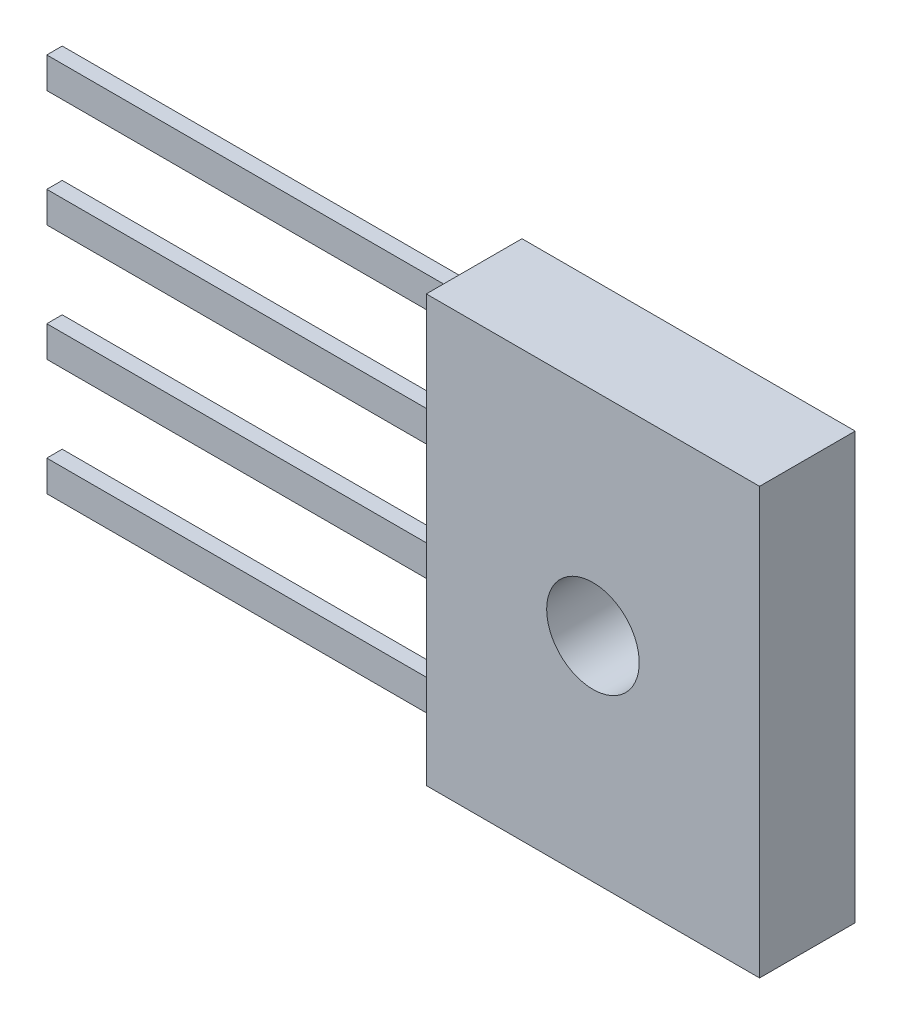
ISO-10303-21;
HEADER;
FILE_DESCRIPTION(('STEP AP214'),'2;1');
FILE_NAME('part.step','',(''),(''),'','','');
FILE_SCHEMA(('AUTOMOTIVE_DESIGN { 1 0 10303 214 1 1 1 1 }'));
ENDSEC;
DATA;
#1=APPLICATION_CONTEXT('core data for automotive mechanical design processes');
#2=APPLICATION_PROTOCOL_DEFINITION('international standard','automotive_design',2000,#1);
#3=PRODUCT_CONTEXT('',#1,'mechanical');
#4=PRODUCT('Part','Part','',(#3));
#5=PRODUCT_RELATED_PRODUCT_CATEGORY('part','',(#4));
#6=PRODUCT_DEFINITION_FORMATION('','',#4);
#7=PRODUCT_DEFINITION_CONTEXT('part definition',#1,'design');
#8=PRODUCT_DEFINITION('design','',#6,#7);
#9=PRODUCT_DEFINITION_SHAPE('','',#8);
#10=(LENGTH_UNIT() NAMED_UNIT(*) SI_UNIT(.MILLI.,.METRE.));
#11=(NAMED_UNIT(*) PLANE_ANGLE_UNIT() SI_UNIT($,.RADIAN.));
#12=(NAMED_UNIT(*) SI_UNIT($,.STERADIAN.) SOLID_ANGLE_UNIT());
#13=UNCERTAINTY_MEASURE_WITH_UNIT(LENGTH_MEASURE(1.E-05),#10,'distance_accuracy_value','');
#14=(GEOMETRIC_REPRESENTATION_CONTEXT(3) GLOBAL_UNCERTAINTY_ASSIGNED_CONTEXT((#13)) GLOBAL_UNIT_ASSIGNED_CONTEXT((#10,
#11,#12)) REPRESENTATION_CONTEXT('',''));
#15=CARTESIAN_POINT('',(0.,0.,0.));
#16=DIRECTION('',(0.,0.,1.));
#17=DIRECTION('',(1.,0.,0.));
#18=AXIS2_PLACEMENT_3D('',#15,#16,#17);
#19=CARTESIAN_POINT('',(-5.4,6.9,1.55));
#20=DIRECTION('',(1.,0.,0.));
#21=DIRECTION('',(0.,1.,0.));
#22=AXIS2_PLACEMENT_3D('',#19,#20,#21);
#23=PLANE('',#22);
#24=DIRECTION('',(0.,0.,1.));
#25=VECTOR('',#24,1.);
#26=CARTESIAN_POINT('',(-5.4,-2.38594130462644,-0.250000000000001));
#27=LINE('',#26,#25);
#28=CARTESIAN_POINT('',(-5.4,-2.38594130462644,-0.250000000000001));
#29=VERTEX_POINT('',#28);
#30=CARTESIAN_POINT('',(-5.4,-2.38594130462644,0.249999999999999));
#31=VERTEX_POINT('',#30);
#32=EDGE_CURVE('E397',#29,#31,#27,.T.);
#33=ORIENTED_EDGE('',*,*,#32,.F.);
#34=DIRECTION('',(0.,-1.,0.));
#35=VECTOR('',#34,1.);
#36=CARTESIAN_POINT('',(-5.4,-1.38594130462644,-0.250000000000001));
#37=LINE('',#36,#35);
#38=CARTESIAN_POINT('',(-5.4,-1.38594130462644,-0.250000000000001));
#39=VERTEX_POINT('',#38);
#40=EDGE_CURVE('E384',#39,#29,#37,.T.);
#41=ORIENTED_EDGE('',*,*,#40,.F.);
#42=DIRECTION('',(0.,0.,-1.));
#43=VECTOR('',#42,1.);
#44=CARTESIAN_POINT('',(-5.4,-1.38594130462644,-0.250000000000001));
#45=LINE('',#44,#43);
#46=CARTESIAN_POINT('',(-5.4,-1.38594130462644,0.249999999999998));
#47=VERTEX_POINT('',#46);
#48=EDGE_CURVE('E389',#47,#39,#45,.T.);
#49=ORIENTED_EDGE('',*,*,#48,.F.);
#50=DIRECTION('',(0.,1.,0.));
#51=VECTOR('',#50,1.);
#52=CARTESIAN_POINT('',(-5.4,-1.38594130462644,0.249999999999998));
#53=LINE('',#52,#51);
#54=EDGE_CURVE('E393',#31,#47,#53,.T.);
#55=ORIENTED_EDGE('',*,*,#54,.F.);
#56=EDGE_LOOP('',(#33,#41,#49,#55));
#57=FACE_BOUND('',#56,.T.);
#58=DIRECTION('',(0.,1.,0.));
#59=VECTOR('',#58,1.);
#60=CARTESIAN_POINT('',(-5.4,6.15782391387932,0.249999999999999));
#61=LINE('',#60,#59);
#62=CARTESIAN_POINT('',(-5.4,5.15782391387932,0.249999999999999));
#63=VERTEX_POINT('',#62);
#64=CARTESIAN_POINT('',(-5.4,6.15782391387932,0.249999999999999));
#65=VERTEX_POINT('',#64);
#66=EDGE_CURVE('E307',#63,#65,#61,.T.);
#67=ORIENTED_EDGE('',*,*,#66,.F.);
#68=DIRECTION('',(0.,0.,1.));
#69=VECTOR('',#68,1.);
#70=CARTESIAN_POINT('',(-5.4,5.15782391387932,-0.250000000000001));
#71=LINE('',#70,#69);
#72=CARTESIAN_POINT('',(-5.4,5.15782391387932,-0.250000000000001));
#73=VERTEX_POINT('',#72);
#74=EDGE_CURVE('E294',#73,#63,#71,.T.);
#75=ORIENTED_EDGE('',*,*,#74,.F.);
#76=DIRECTION('',(0.,-1.,0.));
#77=VECTOR('',#76,1.);
#78=CARTESIAN_POINT('',(-5.4,6.15782391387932,-0.250000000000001));
#79=LINE('',#78,#77);
#80=CARTESIAN_POINT('',(-5.4,6.15782391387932,-0.250000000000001));
#81=VERTEX_POINT('',#80);
#82=EDGE_CURVE('E299',#81,#73,#79,.T.);
#83=ORIENTED_EDGE('',*,*,#82,.F.);
#84=DIRECTION('',(0.,0.,-1.));
#85=VECTOR('',#84,1.);
#86=CARTESIAN_POINT('',(-5.4,6.15782391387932,-0.250000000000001));
#87=LINE('',#86,#85);
#88=EDGE_CURVE('E303',#65,#81,#87,.T.);
#89=ORIENTED_EDGE('',*,*,#88,.F.);
#90=EDGE_LOOP('',(#67,#75,#83,#89));
#91=FACE_BOUND('',#90,.T.);
#92=DIRECTION('',(0.,-1.,0.));
#93=VECTOR('',#92,1.);
#94=CARTESIAN_POINT('',(-5.4,6.9,-1.55));
#95=LINE('',#94,#93);
#96=CARTESIAN_POINT('',(-5.4,6.9,-1.55));
#97=VERTEX_POINT('',#96);
#98=CARTESIAN_POINT('',(-5.4,-6.9,-1.55));
#99=VERTEX_POINT('',#98);
#100=EDGE_CURVE('E230',#97,#99,#95,.T.);
#101=ORIENTED_EDGE('',*,*,#100,.T.);
#102=DIRECTION('',(0.,0.,-1.));
#103=VECTOR('',#102,1.);
#104=CARTESIAN_POINT('',(-5.4,-6.9,1.55));
#105=LINE('',#104,#103);
#106=CARTESIAN_POINT('',(-5.4,-6.9,1.55));
#107=VERTEX_POINT('',#106);
#108=EDGE_CURVE('E221',#107,#99,#105,.T.);
#109=ORIENTED_EDGE('',*,*,#108,.F.);
#110=DIRECTION('',(0.,-1.,0.));
#111=VECTOR('',#110,1.);
#112=CARTESIAN_POINT('',(-5.4,6.9,1.55));
#113=LINE('',#112,#111);
#114=CARTESIAN_POINT('',(-5.4,6.9,1.55));
#115=VERTEX_POINT('',#114);
#116=EDGE_CURVE('E269',#115,#107,#113,.T.);
#117=ORIENTED_EDGE('',*,*,#116,.F.);
#118=DIRECTION('',(0.,0.,-1.));
#119=VECTOR('',#118,1.);
#120=CARTESIAN_POINT('',(-5.4,6.9,1.55));
#121=LINE('',#120,#119);
#122=EDGE_CURVE('E241',#115,#97,#121,.T.);
#123=ORIENTED_EDGE('',*,*,#122,.T.);
#124=EDGE_LOOP('',(#101,#109,#117,#123));
#125=FACE_BOUND('',#124,.T.);
#126=DIRECTION('',(0.,0.,1.));
#127=VECTOR('',#126,1.);
#128=CARTESIAN_POINT('',(-5.4,1.38594130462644,-0.250000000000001));
#129=LINE('',#128,#127);
#130=CARTESIAN_POINT('',(-5.4,1.38594130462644,-0.250000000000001));
#131=VERTEX_POINT('',#130);
#132=CARTESIAN_POINT('',(-5.4,1.38594130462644,0.249999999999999));
#133=VERTEX_POINT('',#132);
#134=EDGE_CURVE('E352',#131,#133,#129,.T.);
#135=ORIENTED_EDGE('',*,*,#134,.F.);
#136=DIRECTION('',(0.,-1.,0.));
#137=VECTOR('',#136,1.);
#138=CARTESIAN_POINT('',(-5.4,2.38594130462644,-0.250000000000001));
#139=LINE('',#138,#137);
#140=CARTESIAN_POINT('',(-5.4,2.38594130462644,-0.250000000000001));
#141=VERTEX_POINT('',#140);
#142=EDGE_CURVE('E339',#141,#131,#139,.T.);
#143=ORIENTED_EDGE('',*,*,#142,.F.);
#144=DIRECTION('',(0.,0.,-1.));
#145=VECTOR('',#144,1.);
#146=CARTESIAN_POINT('',(-5.4,2.38594130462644,-0.250000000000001));
#147=LINE('',#146,#145);
#148=CARTESIAN_POINT('',(-5.4,2.38594130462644,0.249999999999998));
#149=VERTEX_POINT('',#148);
#150=EDGE_CURVE('E344',#149,#141,#147,.T.);
#151=ORIENTED_EDGE('',*,*,#150,.F.);
#152=DIRECTION('',(0.,1.,0.));
#153=VECTOR('',#152,1.);
#154=CARTESIAN_POINT('',(-5.4,2.38594130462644,0.249999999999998));
#155=LINE('',#154,#153);
#156=EDGE_CURVE('E348',#133,#149,#155,.T.);
#157=ORIENTED_EDGE('',*,*,#156,.F.);
#158=EDGE_LOOP('',(#135,#143,#151,#157));
#159=FACE_BOUND('',#158,.T.);
#160=DIRECTION('',(0.,0.,1.));
#161=VECTOR('',#160,1.);
#162=CARTESIAN_POINT('',(-5.4,-6.15782391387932,-0.250000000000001));
#163=LINE('',#162,#161);
#164=CARTESIAN_POINT('',(-5.4,-6.15782391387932,-0.250000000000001));
#165=VERTEX_POINT('',#164);
#166=CARTESIAN_POINT('',(-5.4,-6.15782391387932,0.249999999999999));
#167=VERTEX_POINT('',#166);
#168=EDGE_CURVE('E439',#165,#167,#163,.T.);
#169=ORIENTED_EDGE('',*,*,#168,.F.);
#170=DIRECTION('',(0.,-1.,0.));
#171=VECTOR('',#170,1.);
#172=CARTESIAN_POINT('',(-5.4,-5.15782391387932,-0.250000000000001));
#173=LINE('',#172,#171);
#174=CARTESIAN_POINT('',(-5.4,-5.15782391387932,-0.250000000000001));
#175=VERTEX_POINT('',#174);
#176=EDGE_CURVE('E428',#175,#165,#173,.T.);
#177=ORIENTED_EDGE('',*,*,#176,.F.);
#178=DIRECTION('',(0.,0.,-1.));
#179=VECTOR('',#178,1.);
#180=CARTESIAN_POINT('',(-5.4,-5.15782391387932,-0.250000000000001));
#181=LINE('',#180,#179);
#182=CARTESIAN_POINT('',(-5.4,-5.15782391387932,0.249999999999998));
#183=VERTEX_POINT('',#182);
#184=EDGE_CURVE('E433',#183,#175,#181,.T.);
#185=ORIENTED_EDGE('',*,*,#184,.F.);
#186=DIRECTION('',(0.,1.,0.));
#187=VECTOR('',#186,1.);
#188=CARTESIAN_POINT('',(-5.4,-5.15782391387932,0.249999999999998));
#189=LINE('',#188,#187);
#190=EDGE_CURVE('E72',#167,#183,#189,.T.);
#191=ORIENTED_EDGE('',*,*,#190,.F.);
#192=EDGE_LOOP('',(#169,#177,#185,#191));
#193=FACE_BOUND('',#192,.T.);
#194=ADVANCED_FACE('F49',(#57,#91,#125,#159,#193),#23,.F.);
#195=CARTESIAN_POINT('',(0.,0.,1.55));
#196=DIRECTION('',(0.,0.,1.));
#197=DIRECTION('',(1.,0.,0.));
#198=AXIS2_PLACEMENT_3D('',#195,#196,#197);
#199=PLANE('',#198);
#200=DIRECTION('',(0.,1.,0.));
#201=VECTOR('',#200,1.);
#202=CARTESIAN_POINT('',(5.4,6.9,1.55));
#203=LINE('',#202,#201);
#204=CARTESIAN_POINT('',(5.4,-6.9,1.55));
#205=VERTEX_POINT('',#204);
#206=CARTESIAN_POINT('',(5.4,6.9,1.55));
#207=VERTEX_POINT('',#206);
#208=EDGE_CURVE('E223',#205,#207,#203,.T.);
#209=ORIENTED_EDGE('',*,*,#208,.T.);
#210=DIRECTION('',(-1.,0.,0.));
#211=VECTOR('',#210,1.);
#212=CARTESIAN_POINT('',(-5.4,6.9,1.55));
#213=LINE('',#212,#211);
#214=EDGE_CURVE('E228',#207,#115,#213,.T.);
#215=ORIENTED_EDGE('',*,*,#214,.T.);
#216=ORIENTED_EDGE('',*,*,#116,.T.);
#217=DIRECTION('',(1.,0.,0.));
#218=VECTOR('',#217,1.);
#219=CARTESIAN_POINT('',(-5.4,-6.9,1.55));
#220=LINE('',#219,#218);
#221=EDGE_CURVE('E238',#107,#205,#220,.T.);
#222=ORIENTED_EDGE('',*,*,#221,.T.);
#223=EDGE_LOOP('',(#209,#215,#216,#222));
#224=FACE_BOUND('',#223,.T.);
#225=CARTESIAN_POINT('',(0.,0.,1.55));
#226=DIRECTION('',(0.,0.,1.));
#227=DIRECTION('',(1.,0.,0.));
#228=AXIS2_PLACEMENT_3D('',#225,#226,#227);
#229=CIRCLE('',#228,1.5);
#230=CARTESIAN_POINT('',(-1.5,0.,1.55));
#231=VERTEX_POINT('',#230);
#232=EDGE_CURVE('E259',#231,#231,#229,.T.);
#233=ORIENTED_EDGE('',*,*,#232,.F.);
#234=EDGE_LOOP('',(#233));
#235=FACE_BOUND('',#234,.T.);
#236=ADVANCED_FACE('F473',(#224,#235),#199,.T.);
#237=CARTESIAN_POINT('',(0.,0.,-1.55));
#238=DIRECTION('',(0.,0.,1.));
#239=DIRECTION('',(1.,0.,0.));
#240=AXIS2_PLACEMENT_3D('',#237,#238,#239);
#241=PLANE('',#240);
#242=DIRECTION('',(1.,0.,0.));
#243=VECTOR('',#242,1.);
#244=CARTESIAN_POINT('',(-5.4,-6.9,-1.55));
#245=LINE('',#244,#243);
#246=CARTESIAN_POINT('',(1.6,-6.9,-1.55));
#247=VERTEX_POINT('',#246);
#248=CARTESIAN_POINT('',(5.4,-6.9,-1.55));
#249=VERTEX_POINT('',#248);
#250=EDGE_CURVE('E214',#247,#249,#245,.T.);
#251=ORIENTED_EDGE('',*,*,#250,.F.);
#252=CARTESIAN_POINT('',(0.,-6.9,-1.55));
#253=DIRECTION('',(0.,0.,-1.));
#254=DIRECTION('',(-1.,0.,0.));
#255=AXIS2_PLACEMENT_3D('',#252,#253,#254);
#256=CIRCLE('',#255,1.6);
#257=CARTESIAN_POINT('',(-1.6,-6.9,-1.55));
#258=VERTEX_POINT('',#257);
#259=EDGE_CURVE('E200',#258,#247,#256,.T.);
#260=ORIENTED_EDGE('',*,*,#259,.F.);
#261=EDGE_CURVE('E212',#99,#258,#245,.T.);
#262=ORIENTED_EDGE('',*,*,#261,.F.);
#263=ORIENTED_EDGE('',*,*,#100,.F.);
#264=DIRECTION('',(-1.,0.,0.));
#265=VECTOR('',#264,1.);
#266=CARTESIAN_POINT('',(-5.4,6.9,-1.55));
#267=LINE('',#266,#265);
#268=CARTESIAN_POINT('',(5.4,6.9,-1.55));
#269=VERTEX_POINT('',#268);
#270=EDGE_CURVE('E257',#269,#97,#267,.T.);
#271=ORIENTED_EDGE('',*,*,#270,.F.);
#272=DIRECTION('',(0.,1.,0.));
#273=VECTOR('',#272,1.);
#274=CARTESIAN_POINT('',(5.4,6.9,-1.55));
#275=LINE('',#274,#273);
#276=EDGE_CURVE('E256',#249,#269,#275,.T.);
#277=ORIENTED_EDGE('',*,*,#276,.F.);
#278=EDGE_LOOP('',(#251,#260,#262,#263,#271,#277));
#279=FACE_BOUND('',#278,.T.);
#280=CARTESIAN_POINT('',(0.,0.,-1.55));
#281=DIRECTION('',(0.,0.,1.));
#282=DIRECTION('',(1.,0.,0.));
#283=AXIS2_PLACEMENT_3D('',#280,#281,#282);
#284=CIRCLE('',#283,1.5);
#285=CARTESIAN_POINT('',(-1.5,0.,-1.55));
#286=VERTEX_POINT('',#285);
#287=EDGE_CURVE('E264',#286,#286,#284,.T.);
#288=ORIENTED_EDGE('',*,*,#287,.T.);
#289=EDGE_LOOP('',(#288));
#290=FACE_BOUND('',#289,.T.);
#291=ADVANCED_FACE('F209',(#279,#290),#241,.F.);
#292=CARTESIAN_POINT('',(5.4,6.9,1.55));
#293=DIRECTION('',(-1.,0.,0.));
#294=DIRECTION('',(0.,-1.,0.));
#295=AXIS2_PLACEMENT_3D('',#292,#293,#294);
#296=PLANE('',#295);
#297=ORIENTED_EDGE('',*,*,#276,.T.);
#298=DIRECTION('',(0.,0.,-1.));
#299=VECTOR('',#298,1.);
#300=CARTESIAN_POINT('',(5.4,6.9,1.55));
#301=LINE('',#300,#299);
#302=EDGE_CURVE('E245',#207,#269,#301,.T.);
#303=ORIENTED_EDGE('',*,*,#302,.F.);
#304=ORIENTED_EDGE('',*,*,#208,.F.);
#305=DIRECTION('',(0.,0.,-1.));
#306=VECTOR('',#305,1.);
#307=CARTESIAN_POINT('',(5.4,-6.9,1.55));
#308=LINE('',#307,#306);
#309=EDGE_CURVE('E234',#205,#249,#308,.T.);
#310=ORIENTED_EDGE('',*,*,#309,.T.);
#311=EDGE_LOOP('',(#297,#303,#304,#310));
#312=FACE_BOUND('',#311,.T.);
#313=ADVANCED_FACE('F51',(#312),#296,.F.);
#314=CARTESIAN_POINT('',(-5.4,6.9,1.55));
#315=DIRECTION('',(0.,-1.,0.));
#316=DIRECTION('',(0.,0.,-1.));
#317=AXIS2_PLACEMENT_3D('',#314,#315,#316);
#318=PLANE('',#317);
#319=ORIENTED_EDGE('',*,*,#270,.T.);
#320=ORIENTED_EDGE('',*,*,#122,.F.);
#321=ORIENTED_EDGE('',*,*,#214,.F.);
#322=ORIENTED_EDGE('',*,*,#302,.T.);
#323=EDGE_LOOP('',(#319,#320,#321,#322));
#324=FACE_BOUND('',#323,.T.);
#325=ADVANCED_FACE('F484',(#324),#318,.F.);
#326=CARTESIAN_POINT('',(-5.4,-6.9,1.55));
#327=DIRECTION('',(0.,1.,0.));
#328=DIRECTION('',(0.,0.,1.));
#329=AXIS2_PLACEMENT_3D('',#326,#327,#328);
#330=PLANE('',#329);
#331=DIRECTION('',(-1.,0.,0.));
#332=VECTOR('',#331,1.);
#333=CARTESIAN_POINT('',(-5.4,-6.9,-1.05));
#334=LINE('',#333,#332);
#335=CARTESIAN_POINT('',(1.6,-6.9,-1.05));
#336=VERTEX_POINT('',#335);
#337=CARTESIAN_POINT('',(-1.6,-6.9,-1.05));
#338=VERTEX_POINT('',#337);
#339=EDGE_CURVE('E205',#336,#338,#334,.T.);
#340=ORIENTED_EDGE('',*,*,#339,.F.);
#341=DIRECTION('',(0.,0.,-1.));
#342=VECTOR('',#341,1.);
#343=CARTESIAN_POINT('',(1.6,-6.9,-1.05));
#344=LINE('',#343,#342);
#345=EDGE_CURVE('E11',#336,#247,#344,.T.);
#346=ORIENTED_EDGE('',*,*,#345,.T.);
#347=ORIENTED_EDGE('',*,*,#250,.T.);
#348=ORIENTED_EDGE('',*,*,#309,.F.);
#349=ORIENTED_EDGE('',*,*,#221,.F.);
#350=ORIENTED_EDGE('',*,*,#108,.T.);
#351=ORIENTED_EDGE('',*,*,#261,.T.);
#352=DIRECTION('',(0.,0.,-1.));
#353=VECTOR('',#352,1.);
#354=CARTESIAN_POINT('',(-1.6,-6.9,-1.05));
#355=LINE('',#354,#353);
#356=EDGE_CURVE('E58',#258,#338,#355,.F.);
#357=ORIENTED_EDGE('',*,*,#356,.T.);
#358=EDGE_LOOP('',(#340,#346,#347,#348,#349,#350,#351,#357));
#359=FACE_BOUND('',#358,.T.);
#360=ADVANCED_FACE('F218',(#359),#330,.F.);
#361=CARTESIAN_POINT('',(0.,0.,1.55));
#362=DIRECTION('',(0.,0.,-1.));
#363=DIRECTION('',(-1.,0.,0.));
#364=AXIS2_PLACEMENT_3D('',#361,#362,#363);
#365=CYLINDRICAL_SURFACE('',#364,1.5);
#366=CARTESIAN_POINT('',(-1.5,0.,1.55));
#367=CARTESIAN_POINT('',(-1.5,0.,1.51770833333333));
#368=CARTESIAN_POINT('',(-1.5,0.,1.48541666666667));
#369=CARTESIAN_POINT('',(-1.5,0.,1.42083333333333));
#370=CARTESIAN_POINT('',(-1.5,0.,1.38854166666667));
#371=CARTESIAN_POINT('',(-1.5,0.,1.32395833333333));
#372=CARTESIAN_POINT('',(-1.5,0.,1.29166666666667));
#373=CARTESIAN_POINT('',(-1.5,0.,1.22708333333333));
#374=CARTESIAN_POINT('',(-1.5,0.,1.19479166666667));
#375=CARTESIAN_POINT('',(-1.5,0.,1.13020833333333));
#376=CARTESIAN_POINT('',(-1.5,0.,1.09791666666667));
#377=CARTESIAN_POINT('',(-1.5,0.,1.03333333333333));
#378=CARTESIAN_POINT('',(-1.5,0.,1.00104166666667));
#379=CARTESIAN_POINT('',(-1.5,0.,0.936458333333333));
#380=CARTESIAN_POINT('',(-1.5,0.,0.904166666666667));
#381=CARTESIAN_POINT('',(-1.5,0.,0.839583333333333));
#382=CARTESIAN_POINT('',(-1.5,0.,0.807291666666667));
#383=CARTESIAN_POINT('',(-1.5,0.,0.742708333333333));
#384=CARTESIAN_POINT('',(-1.5,0.,0.710416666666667));
#385=CARTESIAN_POINT('',(-1.5,0.,0.645833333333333));
#386=CARTESIAN_POINT('',(-1.5,0.,0.613541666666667));
#387=CARTESIAN_POINT('',(-1.5,0.,0.548958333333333));
#388=CARTESIAN_POINT('',(-1.5,0.,0.516666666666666));
#389=CARTESIAN_POINT('',(-1.5,0.,0.452083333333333));
#390=CARTESIAN_POINT('',(-1.5,0.,0.419791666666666));
#391=CARTESIAN_POINT('',(-1.5,0.,0.355208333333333));
#392=CARTESIAN_POINT('',(-1.5,0.,0.322916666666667));
#393=CARTESIAN_POINT('',(-1.5,0.,0.258333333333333));
#394=CARTESIAN_POINT('',(-1.5,0.,0.226041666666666));
#395=CARTESIAN_POINT('',(-1.5,0.,0.161458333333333));
#396=CARTESIAN_POINT('',(-1.5,0.,0.129166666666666));
#397=CARTESIAN_POINT('',(-1.5,0.,0.0645833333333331));
#398=CARTESIAN_POINT('',(-1.5,0.,0.0322916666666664));
#399=CARTESIAN_POINT('',(-1.5,0.,-0.0322916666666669));
#400=CARTESIAN_POINT('',(-1.5,0.,-0.0645833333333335));
#401=CARTESIAN_POINT('',(-1.5,0.,-0.129166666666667));
#402=CARTESIAN_POINT('',(-1.5,0.,-0.161458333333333));
#403=CARTESIAN_POINT('',(-1.5,0.,-0.226041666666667));
#404=CARTESIAN_POINT('',(-1.5,0.,-0.258333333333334));
#405=CARTESIAN_POINT('',(-1.5,0.,-0.322916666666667));
#406=CARTESIAN_POINT('',(-1.5,0.,-0.355208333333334));
#407=CARTESIAN_POINT('',(-1.5,0.,-0.419791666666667));
#408=CARTESIAN_POINT('',(-1.5,0.,-0.452083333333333));
#409=CARTESIAN_POINT('',(-1.5,0.,-0.516666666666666));
#410=CARTESIAN_POINT('',(-1.5,0.,-0.548958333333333));
#411=CARTESIAN_POINT('',(-1.5,0.,-0.613541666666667));
#412=CARTESIAN_POINT('',(-1.5,0.,-0.645833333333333));
#413=CARTESIAN_POINT('',(-1.5,0.,-0.710416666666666));
#414=CARTESIAN_POINT('',(-1.5,0.,-0.742708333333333));
#415=CARTESIAN_POINT('',(-1.5,0.,-0.807291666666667));
#416=CARTESIAN_POINT('',(-1.5,0.,-0.839583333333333));
#417=CARTESIAN_POINT('',(-1.5,0.,-0.904166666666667));
#418=CARTESIAN_POINT('',(-1.5,0.,-0.936458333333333));
#419=CARTESIAN_POINT('',(-1.5,0.,-1.00104166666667));
#420=CARTESIAN_POINT('',(-1.5,0.,-1.03333333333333));
#421=CARTESIAN_POINT('',(-1.5,0.,-1.09791666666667));
#422=CARTESIAN_POINT('',(-1.5,0.,-1.13020833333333));
#423=CARTESIAN_POINT('',(-1.5,0.,-1.19479166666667));
#424=CARTESIAN_POINT('',(-1.5,0.,-1.22708333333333));
#425=CARTESIAN_POINT('',(-1.5,0.,-1.29166666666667));
#426=CARTESIAN_POINT('',(-1.5,0.,-1.32395833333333));
#427=CARTESIAN_POINT('',(-1.5,0.,-1.38854166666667));
#428=CARTESIAN_POINT('',(-1.5,0.,-1.42083333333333));
#429=CARTESIAN_POINT('',(-1.5,0.,-1.48541666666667));
#430=CARTESIAN_POINT('',(-1.5,0.,-1.51770833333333));
#431=CARTESIAN_POINT('',(-1.5,0.,-1.55));
#432=B_SPLINE_CURVE_WITH_KNOTS('',3,(#366,#367,#368,#369,#370,#371,#372,#373,#374,#375,#376,
#377,#378,#379,#380,#381,#382,#383,#384,#385,#386,#387,#388,#389,#390,#391,#392,#393,#394,#395,
#396,#397,#398,#399,#400,#401,#402,#403,#404,#405,#406,#407,#408,#409,#410,#411,#412,#413,#414,
#415,#416,#417,#418,#419,#420,#421,#422,#423,#424,#425,#426,#427,#428,#429,#430,#431),
.UNSPECIFIED.,.F.,.F.,(4,2,2,2,2,2,2,2,2,2,2,2,2,2,2,2,2,2,2,2,2,2,2,2,2,2,2,2,2,2,2,2,4),(0.,
0.096875,0.19375,0.290625,0.3875,0.484375,0.58125,0.678125,0.775,0.871875,0.96875,1.065625,
1.1625,1.259375,1.35625,1.453125,1.55,1.646875,1.74375,1.840625,1.9375,2.034375,2.13125,
2.228125,2.325,2.421875,2.51875,2.615625,2.7125,2.809375,2.90625,3.003125,3.1),.UNSPECIFIED.);
#433=EDGE_CURVE('BSEAM491',#231,#286,#432,.T.);
#434=ORIENTED_EDGE('',*,*,#232,.T.);
#435=ORIENTED_EDGE('',*,*,#287,.F.);
#436=ORIENTED_EDGE('',*,*,#433,.T.);
#437=ORIENTED_EDGE('',*,*,#433,.F.);
#438=EDGE_LOOP('',(#434,#436,#435,#437));
#439=FACE_BOUND('',#438,.T.);
#440=ADVANCED_FACE('F491',(#439),#365,.F.);
#441=CARTESIAN_POINT('',(-19.,6.15782391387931,0.249999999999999));
#442=DIRECTION('',(0.,0.,-1.));
#443=DIRECTION('',(0.,1.,0.));
#444=AXIS2_PLACEMENT_3D('',#441,#442,#443);
#445=PLANE('',#444);
#446=ORIENTED_EDGE('',*,*,#66,.T.);
#447=DIRECTION('',(1.,0.,0.));
#448=VECTOR('',#447,1.);
#449=CARTESIAN_POINT('',(-19.,6.15782391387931,0.249999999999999));
#450=LINE('',#449,#448);
#451=CARTESIAN_POINT('',(-19.,6.15782391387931,0.249999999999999));
#452=VERTEX_POINT('',#451);
#453=EDGE_CURVE('E276',#452,#65,#450,.T.);
#454=ORIENTED_EDGE('',*,*,#453,.F.);
#455=DIRECTION('',(0.,1.,0.));
#456=VECTOR('',#455,1.);
#457=CARTESIAN_POINT('',(-19.,6.15782391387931,0.249999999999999));
#458=LINE('',#457,#456);
#459=CARTESIAN_POINT('',(-19.,5.15782391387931,0.249999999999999));
#460=VERTEX_POINT('',#459);
#461=EDGE_CURVE('E298',#460,#452,#458,.T.);
#462=ORIENTED_EDGE('',*,*,#461,.F.);
#463=DIRECTION('',(1.,0.,0.));
#464=VECTOR('',#463,1.);
#465=CARTESIAN_POINT('',(-19.,5.15782391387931,0.249999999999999));
#466=LINE('',#465,#464);
#467=EDGE_CURVE('E289',#460,#63,#466,.T.);
#468=ORIENTED_EDGE('',*,*,#467,.T.);
#469=EDGE_LOOP('',(#446,#454,#462,#468));
#470=FACE_BOUND('',#469,.T.);
#471=ADVANCED_FACE('F502',(#470),#445,.F.);
#472=CARTESIAN_POINT('',(-19.,6.15782391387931,-0.250000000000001));
#473=DIRECTION('',(0.,-1.,0.));
#474=DIRECTION('',(1.,0.,0.));
#475=AXIS2_PLACEMENT_3D('',#472,#473,#474);
#476=PLANE('',#475);
#477=ORIENTED_EDGE('',*,*,#88,.T.);
#478=DIRECTION('',(1.,0.,0.));
#479=VECTOR('',#478,1.);
#480=CARTESIAN_POINT('',(-19.,6.15782391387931,-0.250000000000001));
#481=LINE('',#480,#479);
#482=CARTESIAN_POINT('',(-19.,6.15782391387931,-0.250000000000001));
#483=VERTEX_POINT('',#482);
#484=EDGE_CURVE('E281',#483,#81,#481,.T.);
#485=ORIENTED_EDGE('',*,*,#484,.F.);
#486=DIRECTION('',(0.,0.,-1.));
#487=VECTOR('',#486,1.);
#488=CARTESIAN_POINT('',(-19.,6.15782391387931,-0.250000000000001));
#489=LINE('',#488,#487);
#490=EDGE_CURVE('E317',#452,#483,#489,.T.);
#491=ORIENTED_EDGE('',*,*,#490,.F.);
#492=ORIENTED_EDGE('',*,*,#453,.T.);
#493=EDGE_LOOP('',(#477,#485,#491,#492));
#494=FACE_BOUND('',#493,.T.);
#495=ADVANCED_FACE('F511',(#494),#476,.F.);
#496=CARTESIAN_POINT('',(-19.,6.15782391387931,-0.250000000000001));
#497=DIRECTION('',(0.,0.,1.));
#498=DIRECTION('',(1.,0.,0.));
#499=AXIS2_PLACEMENT_3D('',#496,#497,#498);
#500=PLANE('',#499);
#501=ORIENTED_EDGE('',*,*,#82,.T.);
#502=DIRECTION('',(1.,0.,0.));
#503=VECTOR('',#502,1.);
#504=CARTESIAN_POINT('',(-19.,5.15782391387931,-0.250000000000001));
#505=LINE('',#504,#503);
#506=CARTESIAN_POINT('',(-19.,5.15782391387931,-0.250000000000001));
#507=VERTEX_POINT('',#506);
#508=EDGE_CURVE('E285',#507,#73,#505,.T.);
#509=ORIENTED_EDGE('',*,*,#508,.F.);
#510=DIRECTION('',(0.,-1.,0.));
#511=VECTOR('',#510,1.);
#512=CARTESIAN_POINT('',(-19.,6.15782391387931,-0.250000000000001));
#513=LINE('',#512,#511);
#514=EDGE_CURVE('E314',#483,#507,#513,.T.);
#515=ORIENTED_EDGE('',*,*,#514,.F.);
#516=ORIENTED_EDGE('',*,*,#484,.T.);
#517=EDGE_LOOP('',(#501,#509,#515,#516));
#518=FACE_BOUND('',#517,.T.);
#519=ADVANCED_FACE('F515',(#518),#500,.F.);
#520=CARTESIAN_POINT('',(-19.,5.15782391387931,-0.250000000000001));
#521=DIRECTION('',(0.,1.,0.));
#522=DIRECTION('',(-1.,0.,0.));
#523=AXIS2_PLACEMENT_3D('',#520,#521,#522);
#524=PLANE('',#523);
#525=ORIENTED_EDGE('',*,*,#74,.T.);
#526=ORIENTED_EDGE('',*,*,#467,.F.);
#527=DIRECTION('',(0.,0.,1.));
#528=VECTOR('',#527,1.);
#529=CARTESIAN_POINT('',(-19.,5.15782391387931,-0.250000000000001));
#530=LINE('',#529,#528);
#531=EDGE_CURVE('E293',#507,#460,#530,.T.);
#532=ORIENTED_EDGE('',*,*,#531,.F.);
#533=ORIENTED_EDGE('',*,*,#508,.T.);
#534=EDGE_LOOP('',(#525,#526,#532,#533));
#535=FACE_BOUND('',#534,.T.);
#536=ADVANCED_FACE('F519',(#535),#524,.F.);
#537=CARTESIAN_POINT('',(-19.,0.,0.));
#538=DIRECTION('',(-1.,0.,0.));
#539=DIRECTION('',(0.,0.,1.));
#540=AXIS2_PLACEMENT_3D('',#537,#538,#539);
#541=PLANE('',#540);
#542=ORIENTED_EDGE('',*,*,#461,.T.);
#543=ORIENTED_EDGE('',*,*,#490,.T.);
#544=ORIENTED_EDGE('',*,*,#514,.T.);
#545=ORIENTED_EDGE('',*,*,#531,.T.);
#546=EDGE_LOOP('',(#542,#543,#544,#545));
#547=FACE_BOUND('',#546,.T.);
#548=ADVANCED_FACE('F523',(#547),#541,.T.);
#549=CARTESIAN_POINT('',(-19.,1.38594130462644,-0.250000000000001));
#550=DIRECTION('',(0.,1.,0.));
#551=DIRECTION('',(-1.,0.,0.));
#552=AXIS2_PLACEMENT_3D('',#549,#550,#551);
#553=PLANE('',#552);
#554=ORIENTED_EDGE('',*,*,#134,.T.);
#555=DIRECTION('',(1.,0.,0.));
#556=VECTOR('',#555,1.);
#557=CARTESIAN_POINT('',(-19.,1.38594130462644,0.249999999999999));
#558=LINE('',#557,#556);
#559=CARTESIAN_POINT('',(-19.,1.38594130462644,0.249999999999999));
#560=VERTEX_POINT('',#559);
#561=EDGE_CURVE('E311',#560,#133,#558,.T.);
#562=ORIENTED_EDGE('',*,*,#561,.F.);
#563=DIRECTION('',(0.,0.,1.));
#564=VECTOR('',#563,1.);
#565=CARTESIAN_POINT('',(-19.,1.38594130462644,-0.250000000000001));
#566=LINE('',#565,#564);
#567=CARTESIAN_POINT('',(-19.,1.38594130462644,-0.250000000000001));
#568=VERTEX_POINT('',#567);
#569=EDGE_CURVE('E343',#568,#560,#566,.T.);
#570=ORIENTED_EDGE('',*,*,#569,.F.);
#571=DIRECTION('',(1.,0.,0.));
#572=VECTOR('',#571,1.);
#573=CARTESIAN_POINT('',(-19.,1.38594130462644,-0.250000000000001));
#574=LINE('',#573,#572);
#575=EDGE_CURVE('E334',#568,#131,#574,.T.);
#576=ORIENTED_EDGE('',*,*,#575,.T.);
#577=EDGE_LOOP('',(#554,#562,#570,#576));
#578=FACE_BOUND('',#577,.T.);
#579=ADVANCED_FACE('F527',(#578),#553,.F.);
#580=CARTESIAN_POINT('',(-19.,2.38594130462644,0.249999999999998));
#581=DIRECTION('',(0.,0.,-1.));
#582=DIRECTION('',(0.,1.,0.));
#583=AXIS2_PLACEMENT_3D('',#580,#581,#582);
#584=PLANE('',#583);
#585=ORIENTED_EDGE('',*,*,#156,.T.);
#586=DIRECTION('',(1.,0.,0.));
#587=VECTOR('',#586,1.);
#588=CARTESIAN_POINT('',(-19.,2.38594130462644,0.249999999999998));
#589=LINE('',#588,#587);
#590=CARTESIAN_POINT('',(-19.,2.38594130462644,0.249999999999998));
#591=VERTEX_POINT('',#590);
#592=EDGE_CURVE('E326',#591,#149,#589,.T.);
#593=ORIENTED_EDGE('',*,*,#592,.F.);
#594=DIRECTION('',(0.,1.,0.));
#595=VECTOR('',#594,1.);
#596=CARTESIAN_POINT('',(-19.,2.38594130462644,0.249999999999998));
#597=LINE('',#596,#595);
#598=EDGE_CURVE('E362',#560,#591,#597,.T.);
#599=ORIENTED_EDGE('',*,*,#598,.F.);
#600=ORIENTED_EDGE('',*,*,#561,.T.);
#601=EDGE_LOOP('',(#585,#593,#599,#600));
#602=FACE_BOUND('',#601,.T.);
#603=ADVANCED_FACE('F531',(#602),#584,.F.);
#604=CARTESIAN_POINT('',(-19.,2.38594130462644,-0.250000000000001));
#605=DIRECTION('',(0.,-1.,0.));
#606=DIRECTION('',(1.,0.,0.));
#607=AXIS2_PLACEMENT_3D('',#604,#605,#606);
#608=PLANE('',#607);
#609=ORIENTED_EDGE('',*,*,#150,.T.);
#610=DIRECTION('',(1.,0.,0.));
#611=VECTOR('',#610,1.);
#612=CARTESIAN_POINT('',(-19.,2.38594130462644,-0.250000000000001));
#613=LINE('',#612,#611);
#614=CARTESIAN_POINT('',(-19.,2.38594130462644,-0.250000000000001));
#615=VERTEX_POINT('',#614);
#616=EDGE_CURVE('E330',#615,#141,#613,.T.);
#617=ORIENTED_EDGE('',*,*,#616,.F.);
#618=DIRECTION('',(0.,0.,-1.));
#619=VECTOR('',#618,1.);
#620=CARTESIAN_POINT('',(-19.,2.38594130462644,-0.250000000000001));
#621=LINE('',#620,#619);
#622=EDGE_CURVE('E359',#591,#615,#621,.T.);
#623=ORIENTED_EDGE('',*,*,#622,.F.);
#624=ORIENTED_EDGE('',*,*,#592,.T.);
#625=EDGE_LOOP('',(#609,#617,#623,#624));
#626=FACE_BOUND('',#625,.T.);
#627=ADVANCED_FACE('F535',(#626),#608,.F.);
#628=CARTESIAN_POINT('',(-19.,2.38594130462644,-0.250000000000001));
#629=DIRECTION('',(0.,0.,1.));
#630=DIRECTION('',(1.,0.,0.));
#631=AXIS2_PLACEMENT_3D('',#628,#629,#630);
#632=PLANE('',#631);
#633=ORIENTED_EDGE('',*,*,#142,.T.);
#634=ORIENTED_EDGE('',*,*,#575,.F.);
#635=DIRECTION('',(0.,-1.,0.));
#636=VECTOR('',#635,1.);
#637=CARTESIAN_POINT('',(-19.,2.38594130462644,-0.250000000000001));
#638=LINE('',#637,#636);
#639=EDGE_CURVE('E338',#615,#568,#638,.T.);
#640=ORIENTED_EDGE('',*,*,#639,.F.);
#641=ORIENTED_EDGE('',*,*,#616,.T.);
#642=EDGE_LOOP('',(#633,#634,#640,#641));
#643=FACE_BOUND('',#642,.T.);
#644=ADVANCED_FACE('F539',(#643),#632,.F.);
#645=CARTESIAN_POINT('',(-19.,0.,0.));
#646=DIRECTION('',(1.,0.,0.));
#647=DIRECTION('',(0.,0.,-1.));
#648=AXIS2_PLACEMENT_3D('',#645,#646,#647);
#649=PLANE('',#648);
#650=ORIENTED_EDGE('',*,*,#569,.T.);
#651=ORIENTED_EDGE('',*,*,#598,.T.);
#652=ORIENTED_EDGE('',*,*,#622,.T.);
#653=ORIENTED_EDGE('',*,*,#639,.T.);
#654=EDGE_LOOP('',(#650,#651,#652,#653));
#655=FACE_BOUND('',#654,.T.);
#656=ADVANCED_FACE('F543',(#655),#649,.F.);
#657=CARTESIAN_POINT('',(-19.,-2.38594130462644,-0.250000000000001));
#658=DIRECTION('',(0.,1.,0.));
#659=DIRECTION('',(-1.,0.,0.));
#660=AXIS2_PLACEMENT_3D('',#657,#658,#659);
#661=PLANE('',#660);
#662=ORIENTED_EDGE('',*,*,#32,.T.);
#663=DIRECTION('',(1.,0.,0.));
#664=VECTOR('',#663,1.);
#665=CARTESIAN_POINT('',(-19.,-2.38594130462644,0.249999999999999));
#666=LINE('',#665,#664);
#667=CARTESIAN_POINT('',(-19.,-2.38594130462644,0.249999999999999));
#668=VERTEX_POINT('',#667);
#669=EDGE_CURVE('E356',#668,#31,#666,.T.);
#670=ORIENTED_EDGE('',*,*,#669,.F.);
#671=DIRECTION('',(0.,0.,1.));
#672=VECTOR('',#671,1.);
#673=CARTESIAN_POINT('',(-19.,-2.38594130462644,-0.250000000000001));
#674=LINE('',#673,#672);
#675=CARTESIAN_POINT('',(-19.,-2.38594130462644,-0.250000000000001));
#676=VERTEX_POINT('',#675);
#677=EDGE_CURVE('E388',#676,#668,#674,.T.);
#678=ORIENTED_EDGE('',*,*,#677,.F.);
#679=DIRECTION('',(1.,0.,0.));
#680=VECTOR('',#679,1.);
#681=CARTESIAN_POINT('',(-19.,-2.38594130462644,-0.250000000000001));
#682=LINE('',#681,#680);
#683=EDGE_CURVE('E379',#676,#29,#682,.T.);
#684=ORIENTED_EDGE('',*,*,#683,.T.);
#685=EDGE_LOOP('',(#662,#670,#678,#684));
#686=FACE_BOUND('',#685,.T.);
#687=ADVANCED_FACE('F547',(#686),#661,.F.);
#688=CARTESIAN_POINT('',(-19.,-1.38594130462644,0.249999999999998));
#689=DIRECTION('',(0.,0.,-1.));
#690=DIRECTION('',(0.,1.,0.));
#691=AXIS2_PLACEMENT_3D('',#688,#689,#690);
#692=PLANE('',#691);
#693=ORIENTED_EDGE('',*,*,#54,.T.);
#694=DIRECTION('',(1.,0.,0.));
#695=VECTOR('',#694,1.);
#696=CARTESIAN_POINT('',(-19.,-1.38594130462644,0.249999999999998));
#697=LINE('',#696,#695);
#698=CARTESIAN_POINT('',(-19.,-1.38594130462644,0.249999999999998));
#699=VERTEX_POINT('',#698);
#700=EDGE_CURVE('E371',#699,#47,#697,.T.);
#701=ORIENTED_EDGE('',*,*,#700,.F.);
#702=DIRECTION('',(0.,1.,0.));
#703=VECTOR('',#702,1.);
#704=CARTESIAN_POINT('',(-19.,-1.38594130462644,0.249999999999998));
#705=LINE('',#704,#703);
#706=EDGE_CURVE('E407',#668,#699,#705,.T.);
#707=ORIENTED_EDGE('',*,*,#706,.F.);
#708=ORIENTED_EDGE('',*,*,#669,.T.);
#709=EDGE_LOOP('',(#693,#701,#707,#708));
#710=FACE_BOUND('',#709,.T.);
#711=ADVANCED_FACE('F551',(#710),#692,.F.);
#712=CARTESIAN_POINT('',(-19.,-1.38594130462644,-0.250000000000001));
#713=DIRECTION('',(0.,-1.,0.));
#714=DIRECTION('',(1.,0.,0.));
#715=AXIS2_PLACEMENT_3D('',#712,#713,#714);
#716=PLANE('',#715);
#717=ORIENTED_EDGE('',*,*,#48,.T.);
#718=DIRECTION('',(1.,0.,0.));
#719=VECTOR('',#718,1.);
#720=CARTESIAN_POINT('',(-19.,-1.38594130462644,-0.250000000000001));
#721=LINE('',#720,#719);
#722=CARTESIAN_POINT('',(-19.,-1.38594130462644,-0.250000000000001));
#723=VERTEX_POINT('',#722);
#724=EDGE_CURVE('E375',#723,#39,#721,.T.);
#725=ORIENTED_EDGE('',*,*,#724,.F.);
#726=DIRECTION('',(0.,0.,-1.));
#727=VECTOR('',#726,1.);
#728=CARTESIAN_POINT('',(-19.,-1.38594130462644,-0.250000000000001));
#729=LINE('',#728,#727);
#730=EDGE_CURVE('E404',#699,#723,#729,.T.);
#731=ORIENTED_EDGE('',*,*,#730,.F.);
#732=ORIENTED_EDGE('',*,*,#700,.T.);
#733=EDGE_LOOP('',(#717,#725,#731,#732));
#734=FACE_BOUND('',#733,.T.);
#735=ADVANCED_FACE('F555',(#734),#716,.F.);
#736=CARTESIAN_POINT('',(-19.,-1.38594130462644,-0.250000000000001));
#737=DIRECTION('',(0.,0.,1.));
#738=DIRECTION('',(1.,0.,0.));
#739=AXIS2_PLACEMENT_3D('',#736,#737,#738);
#740=PLANE('',#739);
#741=ORIENTED_EDGE('',*,*,#40,.T.);
#742=ORIENTED_EDGE('',*,*,#683,.F.);
#743=DIRECTION('',(0.,-1.,0.));
#744=VECTOR('',#743,1.);
#745=CARTESIAN_POINT('',(-19.,-1.38594130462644,-0.250000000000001));
#746=LINE('',#745,#744);
#747=EDGE_CURVE('E383',#723,#676,#746,.T.);
#748=ORIENTED_EDGE('',*,*,#747,.F.);
#749=ORIENTED_EDGE('',*,*,#724,.T.);
#750=EDGE_LOOP('',(#741,#742,#748,#749));
#751=FACE_BOUND('',#750,.T.);
#752=ADVANCED_FACE('F559',(#751),#740,.F.);
#753=CARTESIAN_POINT('',(-19.,0.,0.));
#754=DIRECTION('',(1.,0.,0.));
#755=DIRECTION('',(0.,0.,-1.));
#756=AXIS2_PLACEMENT_3D('',#753,#754,#755);
#757=PLANE('',#756);
#758=ORIENTED_EDGE('',*,*,#677,.T.);
#759=ORIENTED_EDGE('',*,*,#706,.T.);
#760=ORIENTED_EDGE('',*,*,#730,.T.);
#761=ORIENTED_EDGE('',*,*,#747,.T.);
#762=EDGE_LOOP('',(#758,#759,#760,#761));
#763=FACE_BOUND('',#762,.T.);
#764=ADVANCED_FACE('F563',(#763),#757,.F.);
#765=CARTESIAN_POINT('',(-19.,-6.15782391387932,-0.250000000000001));
#766=DIRECTION('',(0.,1.,0.));
#767=DIRECTION('',(0.,0.,1.));
#768=AXIS2_PLACEMENT_3D('',#765,#766,#767);
#769=PLANE('',#768);
#770=ORIENTED_EDGE('',*,*,#168,.T.);
#771=DIRECTION('',(1.,0.,0.));
#772=VECTOR('',#771,1.);
#773=CARTESIAN_POINT('',(-19.,-6.15782391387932,0.249999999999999));
#774=LINE('',#773,#772);
#775=CARTESIAN_POINT('',(-19.,-6.15782391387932,0.249999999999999));
#776=VERTEX_POINT('',#775);
#777=EDGE_CURVE('E401',#776,#167,#774,.T.);
#778=ORIENTED_EDGE('',*,*,#777,.F.);
#779=DIRECTION('',(0.,0.,1.));
#780=VECTOR('',#779,1.);
#781=CARTESIAN_POINT('',(-19.,-6.15782391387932,-0.250000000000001));
#782=LINE('',#781,#780);
#783=CARTESIAN_POINT('',(-19.,-6.15782391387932,-0.250000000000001));
#784=VERTEX_POINT('',#783);
#785=EDGE_CURVE('E432',#784,#776,#782,.T.);
#786=ORIENTED_EDGE('',*,*,#785,.F.);
#787=DIRECTION('',(1.,0.,0.));
#788=VECTOR('',#787,1.);
#789=CARTESIAN_POINT('',(-19.,-6.15782391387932,-0.250000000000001));
#790=LINE('',#789,#788);
#791=EDGE_CURVE('E423',#784,#165,#790,.T.);
#792=ORIENTED_EDGE('',*,*,#791,.T.);
#793=EDGE_LOOP('',(#770,#778,#786,#792));
#794=FACE_BOUND('',#793,.T.);
#795=ADVANCED_FACE('F463',(#794),#769,.F.);
#796=CARTESIAN_POINT('',(-19.,-5.15782391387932,0.249999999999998));
#797=DIRECTION('',(0.,0.,-1.));
#798=DIRECTION('',(0.,1.,0.));
#799=AXIS2_PLACEMENT_3D('',#796,#797,#798);
#800=PLANE('',#799);
#801=ORIENTED_EDGE('',*,*,#190,.T.);
#802=DIRECTION('',(1.,0.,0.));
#803=VECTOR('',#802,1.);
#804=CARTESIAN_POINT('',(-19.,-5.15782391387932,0.249999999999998));
#805=LINE('',#804,#803);
#806=CARTESIAN_POINT('',(-19.,-5.15782391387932,0.249999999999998));
#807=VERTEX_POINT('',#806);
#808=EDGE_CURVE('E415',#807,#183,#805,.T.);
#809=ORIENTED_EDGE('',*,*,#808,.F.);
#810=DIRECTION('',(0.,1.,0.));
#811=VECTOR('',#810,1.);
#812=CARTESIAN_POINT('',(-19.,-5.15782391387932,0.249999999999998));
#813=LINE('',#812,#811);
#814=EDGE_CURVE('E448',#776,#807,#813,.T.);
#815=ORIENTED_EDGE('',*,*,#814,.F.);
#816=ORIENTED_EDGE('',*,*,#777,.T.);
#817=EDGE_LOOP('',(#801,#809,#815,#816));
#818=FACE_BOUND('',#817,.T.);
#819=ADVANCED_FACE('F465',(#818),#800,.F.);
#820=CARTESIAN_POINT('',(-19.,-5.15782391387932,-0.250000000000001));
#821=DIRECTION('',(0.,-1.,0.));
#822=DIRECTION('',(1.,0.,0.));
#823=AXIS2_PLACEMENT_3D('',#820,#821,#822);
#824=PLANE('',#823);
#825=ORIENTED_EDGE('',*,*,#184,.T.);
#826=DIRECTION('',(1.,0.,0.));
#827=VECTOR('',#826,1.);
#828=CARTESIAN_POINT('',(-19.,-5.15782391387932,-0.250000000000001));
#829=LINE('',#828,#827);
#830=CARTESIAN_POINT('',(-19.,-5.15782391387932,-0.250000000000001));
#831=VERTEX_POINT('',#830);
#832=EDGE_CURVE('E419',#831,#175,#829,.T.);
#833=ORIENTED_EDGE('',*,*,#832,.F.);
#834=DIRECTION('',(0.,0.,-1.));
#835=VECTOR('',#834,1.);
#836=CARTESIAN_POINT('',(-19.,-5.15782391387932,-0.250000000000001));
#837=LINE('',#836,#835);
#838=EDGE_CURVE('E445',#807,#831,#837,.T.);
#839=ORIENTED_EDGE('',*,*,#838,.F.);
#840=ORIENTED_EDGE('',*,*,#808,.T.);
#841=EDGE_LOOP('',(#825,#833,#839,#840));
#842=FACE_BOUND('',#841,.T.);
#843=ADVANCED_FACE('F469',(#842),#824,.F.);
#844=CARTESIAN_POINT('',(-19.,-5.15782391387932,-0.250000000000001));
#845=DIRECTION('',(0.,0.,1.));
#846=DIRECTION('',(1.,0.,0.));
#847=AXIS2_PLACEMENT_3D('',#844,#845,#846);
#848=PLANE('',#847);
#849=ORIENTED_EDGE('',*,*,#176,.T.);
#850=ORIENTED_EDGE('',*,*,#791,.F.);
#851=DIRECTION('',(0.,-1.,0.));
#852=VECTOR('',#851,1.);
#853=CARTESIAN_POINT('',(-19.,-5.15782391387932,-0.250000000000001));
#854=LINE('',#853,#852);
#855=EDGE_CURVE('E427',#831,#784,#854,.T.);
#856=ORIENTED_EDGE('',*,*,#855,.F.);
#857=ORIENTED_EDGE('',*,*,#832,.T.);
#858=EDGE_LOOP('',(#849,#850,#856,#857));
#859=FACE_BOUND('',#858,.T.);
#860=ADVANCED_FACE('F471',(#859),#848,.F.);
#861=CARTESIAN_POINT('',(-19.,0.,0.));
#862=DIRECTION('',(1.,0.,0.));
#863=DIRECTION('',(0.,0.,-1.));
#864=AXIS2_PLACEMENT_3D('',#861,#862,#863);
#865=PLANE('',#864);
#866=ORIENTED_EDGE('',*,*,#785,.T.);
#867=ORIENTED_EDGE('',*,*,#814,.T.);
#868=ORIENTED_EDGE('',*,*,#838,.T.);
#869=ORIENTED_EDGE('',*,*,#855,.T.);
#870=EDGE_LOOP('',(#866,#867,#868,#869));
#871=FACE_BOUND('',#870,.T.);
#872=ADVANCED_FACE('F458',(#871),#865,.F.);
#873=CARTESIAN_POINT('',(0.,-6.9,-1.05));
#874=DIRECTION('',(0.,0.,-1.));
#875=DIRECTION('',(-1.,0.,0.));
#876=AXIS2_PLACEMENT_3D('',#873,#874,#875);
#877=CYLINDRICAL_SURFACE('',#876,1.6);
#878=CARTESIAN_POINT('',(0.,-6.9,-1.05));
#879=DIRECTION('',(0.,0.,-1.));
#880=DIRECTION('',(-1.,0.,0.));
#881=AXIS2_PLACEMENT_3D('',#878,#879,#880);
#882=CIRCLE('',#881,1.6);
#883=EDGE_CURVE('E64',#338,#336,#882,.T.);
#884=ORIENTED_EDGE('',*,*,#883,.F.);
#885=ORIENTED_EDGE('',*,*,#356,.F.);
#886=ORIENTED_EDGE('',*,*,#259,.T.);
#887=ORIENTED_EDGE('',*,*,#345,.F.);
#888=EDGE_LOOP('',(#884,#885,#886,#887));
#889=FACE_BOUND('',#888,.T.);
#890=ADVANCED_FACE('F199',(#889),#877,.F.);
#891=CARTESIAN_POINT('',(0.,-6.9,-1.05));
#892=DIRECTION('',(0.,0.,-1.));
#893=DIRECTION('',(-1.,0.,0.));
#894=AXIS2_PLACEMENT_3D('',#891,#892,#893);
#895=PLANE('',#894);
#896=ORIENTED_EDGE('',*,*,#339,.T.);
#897=ORIENTED_EDGE('',*,*,#883,.T.);
#898=EDGE_LOOP('',(#896,#897));
#899=FACE_BOUND('',#898,.T.);
#900=ADVANCED_FACE('F250',(#899),#895,.T.);
#901=CLOSED_SHELL('',(#194,#236,#291,#313,#325,#360,#440,#471,#495,#519,#536,#548,#579,#603,
#627,#644,#656,#687,#711,#735,#752,#764,#795,#819,#843,#860,#872,#890,#900));
#902=MANIFOLD_SOLID_BREP('B2',#901);
#903=ADVANCED_BREP_SHAPE_REPRESENTATION('',(#18,#902),#14);
#904=SHAPE_DEFINITION_REPRESENTATION(#9,#903);
ENDSEC;
END-ISO-10303-21;
